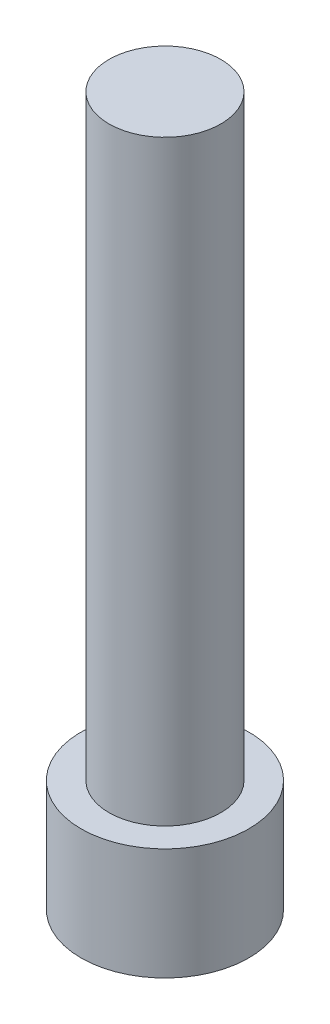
from build123d import *

# Parameters (mm, degrees)
SKETCH_1_R          = 2.25
EXTRUDE_1_DEPTH     = 3
SKETCH_2_R          = 1.5
EXTRUDE_2_DEPTH     = 16
CUT_EXTRUDE_1_DEPTH = 1.5


with BuildPart() as part:
    # Sketch 1 → Extrude 1 (new body)
    with BuildSketch(Plane(origin=(0, 0, 0), x_dir=(1, 0, 0), z_dir=(0, 1, 0))):
        with Locations(Location((0, 0, 0), (0, 0, 270))):
            Circle(SKETCH_1_R)
    extrude(amount=EXTRUDE_1_DEPTH)

    # Sketch 2 → Extrude 2 (add)
    with BuildSketch(Plane(origin=(0, 3, 0), x_dir=(1, 0, 0), z_dir=(0, 1, 0))):
        with Locations(Location((0, 0, 0), (0, 0, 270))):
            Circle(SKETCH_2_R)
    extrude(amount=EXTRUDE_2_DEPTH)

    # Sketch 3 → Cut-Extrude 1 (cut)
    with BuildSketch(Plane.XZ):
        Polygon((1.091681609, -0.944226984), (1.36356536, 0.473310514), (0.271883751, 1.417537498), (-1.091681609, 0.944226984), (-1.36356536, -0.473310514), (-0.271883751, -1.417537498), align=None)
    extrude(amount=-CUT_EXTRUDE_1_DEPTH, mode=Mode.SUBTRACT)


solid = part.part
